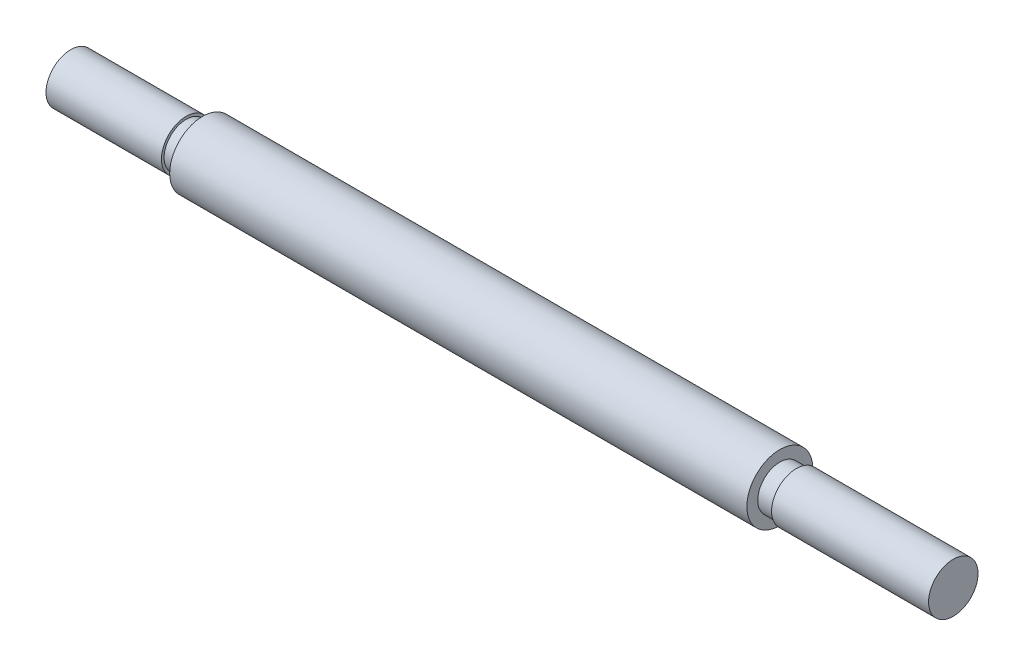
ISO-10303-21;
HEADER;
FILE_DESCRIPTION(('STEP AP214'),'2;1');
FILE_NAME('part.step','',(''),(''),'','','');
FILE_SCHEMA(('AUTOMOTIVE_DESIGN { 1 0 10303 214 1 1 1 1 }'));
ENDSEC;
DATA;
#1=APPLICATION_CONTEXT('core data for automotive mechanical design processes');
#2=APPLICATION_PROTOCOL_DEFINITION('international standard','automotive_design',2000,#1);
#3=PRODUCT_CONTEXT('',#1,'mechanical');
#4=PRODUCT('Part','Part','',(#3));
#5=PRODUCT_RELATED_PRODUCT_CATEGORY('part','',(#4));
#6=PRODUCT_DEFINITION_FORMATION('','',#4);
#7=PRODUCT_DEFINITION_CONTEXT('part definition',#1,'design');
#8=PRODUCT_DEFINITION('design','',#6,#7);
#9=PRODUCT_DEFINITION_SHAPE('','',#8);
#10=(LENGTH_UNIT() NAMED_UNIT(*) SI_UNIT(.MILLI.,.METRE.));
#11=(NAMED_UNIT(*) PLANE_ANGLE_UNIT() SI_UNIT($,.RADIAN.));
#12=(NAMED_UNIT(*) SI_UNIT($,.STERADIAN.) SOLID_ANGLE_UNIT());
#13=UNCERTAINTY_MEASURE_WITH_UNIT(LENGTH_MEASURE(1.E-05),#10,'distance_accuracy_value','');
#14=(GEOMETRIC_REPRESENTATION_CONTEXT(3) GLOBAL_UNCERTAINTY_ASSIGNED_CONTEXT((#13)) GLOBAL_UNIT_ASSIGNED_CONTEXT((#10,
#11,#12)) REPRESENTATION_CONTEXT('',''));
#15=CARTESIAN_POINT('',(0.,0.,0.));
#16=DIRECTION('',(0.,0.,1.));
#17=DIRECTION('',(1.,0.,0.));
#18=AXIS2_PLACEMENT_3D('',#15,#16,#17);
#19=CARTESIAN_POINT('',(0.,0.,0.));
#20=DIRECTION('',(1.,0.,0.));
#21=DIRECTION('',(0.,0.,-1.));
#22=AXIS2_PLACEMENT_3D('',#19,#20,#21);
#23=PLANE('',#22);
#24=CARTESIAN_POINT('',(0.,0.,0.));
#25=DIRECTION('',(-1.,0.,0.));
#26=DIRECTION('',(0.,0.,1.));
#27=AXIS2_PLACEMENT_3D('',#24,#25,#26);
#28=CIRCLE('',#27,9.525);
#29=CARTESIAN_POINT('',(0.,0.,9.525));
#30=VERTEX_POINT('',#29);
#31=EDGE_CURVE('E10',#30,#30,#28,.T.);
#32=ORIENTED_EDGE('',*,*,#31,.T.);
#33=EDGE_LOOP('',(#32));
#34=FACE_BOUND('',#33,.T.);
#35=ADVANCED_FACE('F24',(#34),#23,.F.);
#36=CARTESIAN_POINT('',(0.,0.,0.));
#37=DIRECTION('',(-1.,0.,0.));
#38=DIRECTION('',(0.,0.,1.));
#39=AXIS2_PLACEMENT_3D('',#36,#37,#38);
#40=CYLINDRICAL_SURFACE('',#39,9.525);
#41=ORIENTED_EDGE('',*,*,#31,.F.);
#42=EDGE_LOOP('',(#41));
#43=FACE_BOUND('',#42,.T.);
#44=CARTESIAN_POINT('',(44.45,0.,0.));
#45=DIRECTION('',(-1.,0.,0.));
#46=DIRECTION('',(0.,0.,1.));
#47=AXIS2_PLACEMENT_3D('',#44,#45,#46);
#48=CIRCLE('',#47,9.525);
#49=CARTESIAN_POINT('',(44.45,0.,9.525));
#50=VERTEX_POINT('',#49);
#51=EDGE_CURVE('E30',#50,#50,#48,.T.);
#52=ORIENTED_EDGE('',*,*,#51,.T.);
#53=EDGE_LOOP('',(#52));
#54=FACE_BOUND('',#53,.T.);
#55=ADVANCED_FACE('F74',(#43,#54),#40,.T.);
#56=CARTESIAN_POINT('',(44.45,0.,-9.525));
#57=DIRECTION('',(-1.,0.,0.));
#58=DIRECTION('',(0.,0.,1.));
#59=AXIS2_PLACEMENT_3D('',#56,#57,#58);
#60=PLANE('',#59);
#61=ORIENTED_EDGE('',*,*,#51,.F.);
#62=EDGE_LOOP('',(#61));
#63=FACE_BOUND('',#62,.T.);
#64=CARTESIAN_POINT('',(44.45,0.,0.));
#65=DIRECTION('',(-1.,0.,0.));
#66=DIRECTION('',(0.,0.,1.));
#67=AXIS2_PLACEMENT_3D('',#64,#65,#66);
#68=CIRCLE('',#67,8.509);
#69=CARTESIAN_POINT('',(44.45,0.,8.509));
#70=VERTEX_POINT('',#69);
#71=EDGE_CURVE('E34',#70,#70,#68,.T.);
#72=ORIENTED_EDGE('',*,*,#71,.T.);
#73=EDGE_LOOP('',(#72));
#74=FACE_BOUND('',#73,.T.);
#75=ADVANCED_FACE('F78',(#63,#74),#60,.F.);
#76=CARTESIAN_POINT('',(0.,0.,0.));
#77=DIRECTION('',(-1.,0.,0.));
#78=DIRECTION('',(0.,0.,1.));
#79=AXIS2_PLACEMENT_3D('',#76,#77,#78);
#80=CYLINDRICAL_SURFACE('',#79,8.509);
#81=ORIENTED_EDGE('',*,*,#71,.F.);
#82=EDGE_LOOP('',(#81));
#83=FACE_BOUND('',#82,.T.);
#84=CARTESIAN_POINT('',(50.8,0.,0.));
#85=DIRECTION('',(-1.,0.,0.));
#86=DIRECTION('',(0.,0.,1.));
#87=AXIS2_PLACEMENT_3D('',#84,#85,#86);
#88=CIRCLE('',#87,8.509);
#89=CARTESIAN_POINT('',(50.8,0.,8.509));
#90=VERTEX_POINT('',#89);
#91=EDGE_CURVE('E38',#90,#90,#88,.T.);
#92=ORIENTED_EDGE('',*,*,#91,.T.);
#93=EDGE_LOOP('',(#92));
#94=FACE_BOUND('',#93,.T.);
#95=ADVANCED_FACE('F83',(#83,#94),#80,.T.);
#96=CARTESIAN_POINT('',(50.8,0.,-8.509));
#97=DIRECTION('',(1.,0.,0.));
#98=DIRECTION('',(0.,0.,-1.));
#99=AXIS2_PLACEMENT_3D('',#96,#97,#98);
#100=PLANE('',#99);
#101=ORIENTED_EDGE('',*,*,#91,.F.);
#102=EDGE_LOOP('',(#101));
#103=FACE_BOUND('',#102,.T.);
#104=CARTESIAN_POINT('',(50.8,0.,0.));
#105=DIRECTION('',(-1.,0.,0.));
#106=DIRECTION('',(0.,0.,1.));
#107=AXIS2_PLACEMENT_3D('',#104,#105,#106);
#108=CIRCLE('',#107,12.7);
#109=CARTESIAN_POINT('',(50.8,0.,12.7));
#110=VERTEX_POINT('',#109);
#111=EDGE_CURVE('E43',#110,#110,#108,.T.);
#112=ORIENTED_EDGE('',*,*,#111,.T.);
#113=EDGE_LOOP('',(#112));
#114=FACE_BOUND('',#113,.T.);
#115=ADVANCED_FACE('F89',(#103,#114),#100,.F.);
#116=CARTESIAN_POINT('',(0.,0.,0.));
#117=DIRECTION('',(-1.,0.,0.));
#118=DIRECTION('',(0.,0.,1.));
#119=AXIS2_PLACEMENT_3D('',#116,#117,#118);
#120=CYLINDRICAL_SURFACE('',#119,12.7);
#121=ORIENTED_EDGE('',*,*,#111,.F.);
#122=EDGE_LOOP('',(#121));
#123=FACE_BOUND('',#122,.T.);
#124=CARTESIAN_POINT('',(273.05,0.,0.));
#125=DIRECTION('',(-1.,0.,0.));
#126=DIRECTION('',(0.,0.,1.));
#127=AXIS2_PLACEMENT_3D('',#124,#125,#126);
#128=CIRCLE('',#127,12.7);
#129=CARTESIAN_POINT('',(273.05,0.,12.7));
#130=VERTEX_POINT('',#129);
#131=EDGE_CURVE('E46',#130,#130,#128,.T.);
#132=ORIENTED_EDGE('',*,*,#131,.T.);
#133=EDGE_LOOP('',(#132));
#134=FACE_BOUND('',#133,.T.);
#135=ADVANCED_FACE('F93',(#123,#134),#120,.T.);
#136=CARTESIAN_POINT('',(273.05,0.,-12.7));
#137=DIRECTION('',(-1.,0.,0.));
#138=DIRECTION('',(0.,0.,1.));
#139=AXIS2_PLACEMENT_3D('',#136,#137,#138);
#140=PLANE('',#139);
#141=ORIENTED_EDGE('',*,*,#131,.F.);
#142=EDGE_LOOP('',(#141));
#143=FACE_BOUND('',#142,.T.);
#144=CARTESIAN_POINT('',(273.05,0.,0.));
#145=DIRECTION('',(-1.,0.,0.));
#146=DIRECTION('',(0.,0.,1.));
#147=AXIS2_PLACEMENT_3D('',#144,#145,#146);
#148=CIRCLE('',#147,8.509);
#149=CARTESIAN_POINT('',(273.05,0.,8.509));
#150=VERTEX_POINT('',#149);
#151=EDGE_CURVE('E49',#150,#150,#148,.T.);
#152=ORIENTED_EDGE('',*,*,#151,.T.);
#153=EDGE_LOOP('',(#152));
#154=FACE_BOUND('',#153,.T.);
#155=ADVANCED_FACE('F97',(#143,#154),#140,.F.);
#156=CARTESIAN_POINT('',(0.,0.,0.));
#157=DIRECTION('',(-1.,0.,0.));
#158=DIRECTION('',(0.,0.,1.));
#159=AXIS2_PLACEMENT_3D('',#156,#157,#158);
#160=CYLINDRICAL_SURFACE('',#159,8.509);
#161=ORIENTED_EDGE('',*,*,#151,.F.);
#162=EDGE_LOOP('',(#161));
#163=FACE_BOUND('',#162,.T.);
#164=CARTESIAN_POINT('',(279.4,0.,0.));
#165=DIRECTION('',(-1.,0.,0.));
#166=DIRECTION('',(0.,0.,1.));
#167=AXIS2_PLACEMENT_3D('',#164,#165,#166);
#168=CIRCLE('',#167,8.509);
#169=CARTESIAN_POINT('',(279.4,0.,8.509));
#170=VERTEX_POINT('',#169);
#171=EDGE_CURVE('E52',#170,#170,#168,.T.);
#172=ORIENTED_EDGE('',*,*,#171,.T.);
#173=EDGE_LOOP('',(#172));
#174=FACE_BOUND('',#173,.T.);
#175=ADVANCED_FACE('F101',(#163,#174),#160,.T.);
#176=CARTESIAN_POINT('',(279.4,0.,-8.509));
#177=DIRECTION('',(1.,0.,0.));
#178=DIRECTION('',(0.,0.,-1.));
#179=AXIS2_PLACEMENT_3D('',#176,#177,#178);
#180=PLANE('',#179);
#181=ORIENTED_EDGE('',*,*,#171,.F.);
#182=EDGE_LOOP('',(#181));
#183=FACE_BOUND('',#182,.T.);
#184=CARTESIAN_POINT('',(279.4,0.,0.));
#185=DIRECTION('',(-1.,0.,0.));
#186=DIRECTION('',(0.,0.,1.));
#187=AXIS2_PLACEMENT_3D('',#184,#185,#186);
#188=CIRCLE('',#187,9.525);
#189=CARTESIAN_POINT('',(279.4,0.,9.525));
#190=VERTEX_POINT('',#189);
#191=EDGE_CURVE('E55',#190,#190,#188,.T.);
#192=ORIENTED_EDGE('',*,*,#191,.T.);
#193=EDGE_LOOP('',(#192));
#194=FACE_BOUND('',#193,.T.);
#195=ADVANCED_FACE('F70',(#183,#194),#180,.F.);
#196=CARTESIAN_POINT('',(0.,0.,0.));
#197=DIRECTION('',(-1.,0.,0.));
#198=DIRECTION('',(0.,0.,1.));
#199=AXIS2_PLACEMENT_3D('',#196,#197,#198);
#200=CYLINDRICAL_SURFACE('',#199,9.525);
#201=ORIENTED_EDGE('',*,*,#191,.F.);
#202=EDGE_LOOP('',(#201));
#203=FACE_BOUND('',#202,.T.);
#204=CARTESIAN_POINT('',(339.852,0.,0.));
#205=DIRECTION('',(-1.,0.,0.));
#206=DIRECTION('',(0.,0.,1.));
#207=AXIS2_PLACEMENT_3D('',#204,#205,#206);
#208=CIRCLE('',#207,9.525);
#209=CARTESIAN_POINT('',(339.852,0.,9.525));
#210=VERTEX_POINT('',#209);
#211=EDGE_CURVE('E58',#210,#210,#208,.T.);
#212=ORIENTED_EDGE('',*,*,#211,.T.);
#213=EDGE_LOOP('',(#212));
#214=FACE_BOUND('',#213,.T.);
#215=ADVANCED_FACE('F62',(#203,#214),#200,.T.);
#216=CARTESIAN_POINT('',(339.852,0.,-9.525));
#217=DIRECTION('',(-1.,0.,0.));
#218=DIRECTION('',(0.,0.,1.));
#219=AXIS2_PLACEMENT_3D('',#216,#217,#218);
#220=PLANE('',#219);
#221=ORIENTED_EDGE('',*,*,#211,.F.);
#222=EDGE_LOOP('',(#221));
#223=FACE_BOUND('',#222,.T.);
#224=ADVANCED_FACE('F64',(#223),#220,.F.);
#225=CLOSED_SHELL('',(#35,#55,#75,#95,#115,#135,#155,#175,#195,#215,#224));
#226=MANIFOLD_SOLID_BREP('B2',#225);
#227=ADVANCED_BREP_SHAPE_REPRESENTATION('',(#18,#226),#14);
#228=SHAPE_DEFINITION_REPRESENTATION(#9,#227);
ENDSEC;
END-ISO-10303-21;
